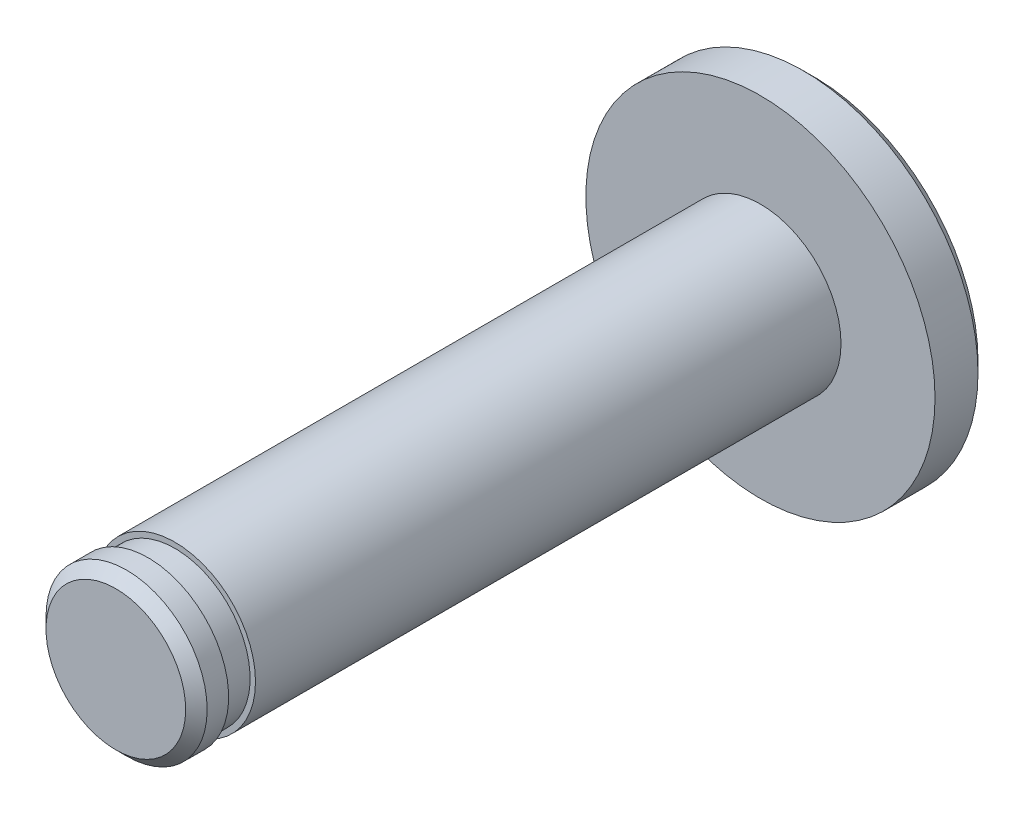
from build123d import *

# Parameters (mm, degrees)
ESQUISSE1_R      = 3.25
EXTRUSION1_DEPTH = 1
ESQUISSE2_R      = 1.5
EXTRUSION2_DEPTH = 12
CHANFREIN1_SIZE  = 0.2
ESQUISSE3_W      = 0.356487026
ESQUISSE3_H      = 0.5


with BuildPart() as part:
    # Esquisse1 → Extrusion1 (new body)
    with BuildSketch(Plane.XY):
        Circle(ESQUISSE1_R)
    extrude(amount=EXTRUSION1_DEPTH)

    # Esquisse2 → Extrusion2 (add)
    with BuildSketch(Plane.XY.offset(1)):
        Circle(ESQUISSE2_R)
    extrude(amount=EXTRUSION2_DEPTH)

    # Chanfrein1
    chanfrein1_edges = [part.edges().sort_by_distance(p)[0] for p in [
        (-3.25, 0, 0),
        (-1.5, 0, 13),
    ]]
    chamfer(chanfrein1_edges, length=CHANFREIN1_SIZE)

    # Esquisse3 → Enl_vement de mati_re-R_volution1 (revolve, cut)
    with BuildSketch(Plane(origin=(0, 0, 0), x_dir=(1, 0, 0), z_dir=(0, 1, 0)), mode=Mode.PRIVATE) as enl_vement_de_mati_re_r_volution1_sk:
        with Locations((1.578243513, -12.15)):
            Rectangle(ESQUISSE3_W, ESQUISSE3_H)
    revolve(enl_vement_de_mati_re_r_volution1_sk.sketch.rotate(Axis((0, 0, 0), (0, 0, 1)), 180), axis=Axis((0, 0, 0), (0, 0, 1)), mode=Mode.SUBTRACT)


solid = part.part
